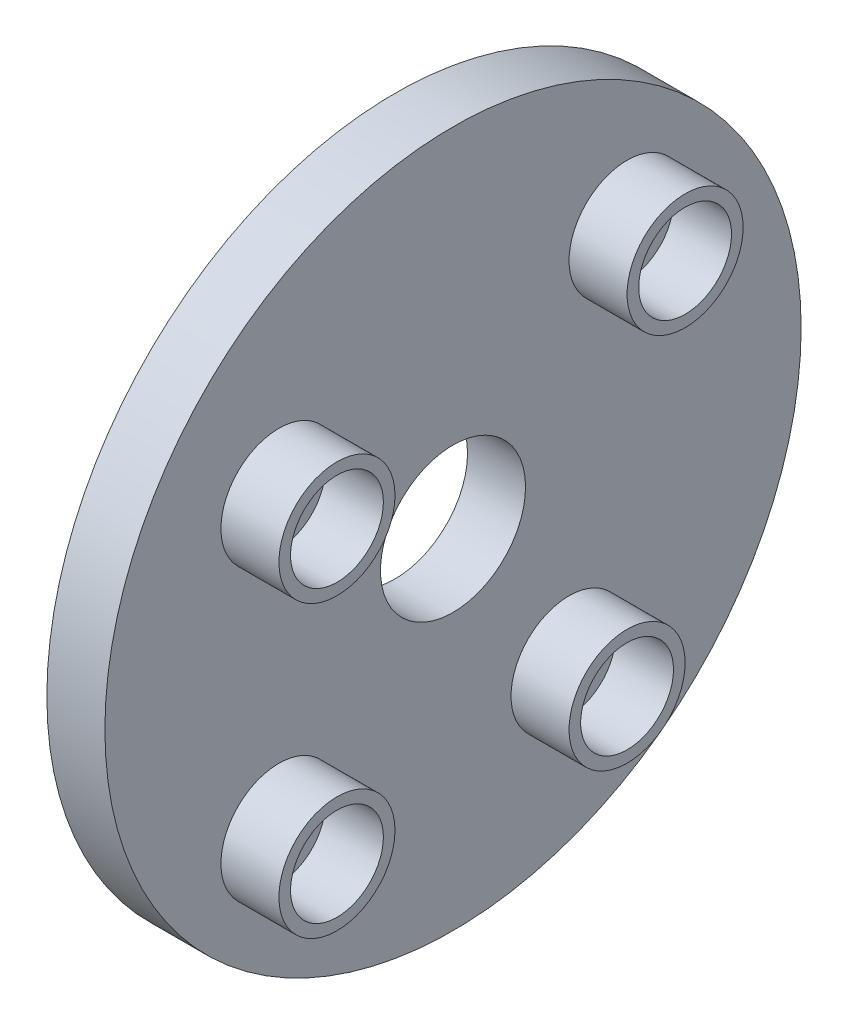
from build123d import *

# Parameters (mm, degrees)
SKETCH1_R        = 10
SKETCH1_R_2      = 8
EXTRUDE1_DEPTH   = 10
EXTRUDE1_2_DEPTH = 10
EXTRUDE1_3_DEPTH = 10
EXTRUDE1_4_DEPTH = 10
SKETCH3_R        = 60
SKETCH3_R_2      = 12.5
EXTRUDE2_DEPTH   = 10


with BuildPart() as part:
    # Sketch1 → Extrude1 (new body)
    with BuildSketch(Plane(origin=(0, 0, 0), x_dir=(0, 0, -1), z_dir=(1, 0, 0))):
        with Locations((-30, -30)):
            Circle(SKETCH1_R)
        with Locations((-30, -30)):
            Circle(SKETCH1_R_2, mode=Mode.SUBTRACT)
    extrude(amount=EXTRUDE1_DEPTH)



with BuildPart() as body_2:
    # Sketch1 → Extrude1 2 (new body)
    with BuildSketch(Plane(origin=(0, 0, 0), x_dir=(0, 0, -1), z_dir=(1, 0, 0))):
        with Locations((20, -30)):
            Circle(SKETCH1_R)
        with Locations((20, -30)):
            Circle(SKETCH1_R_2, mode=Mode.SUBTRACT)
    extrude(amount=EXTRUDE1_2_DEPTH)


with BuildPart() as body_3:
    # Sketch1 → Extrude1 3 (new body)
    with BuildSketch(Plane(origin=(0, 0, 0), x_dir=(0, 0, -1), z_dir=(1, 0, 0))):
        with Locations((30, 30)):
            Circle(SKETCH1_R)
        with Locations((30, 30)):
            Circle(SKETCH1_R_2, mode=Mode.SUBTRACT)
    extrude(amount=EXTRUDE1_3_DEPTH)


with BuildPart() as body_4:
    # Sketch1 → Extrude1 4 (new body)
    with BuildSketch(Plane(origin=(0, 0, 0), x_dir=(0, 0, -1), z_dir=(1, 0, 0))):
        with Locations((-30, 20)):
            Circle(SKETCH1_R)
        with Locations((-30, 20)):
            Circle(SKETCH1_R_2, mode=Mode.SUBTRACT)
    extrude(amount=EXTRUDE1_4_DEPTH)


with BuildPart() as part_1:
    add(part.part)

    add(body_2.part)  # Extrude2 merges body 2

    add(body_3.part)  # Extrude2 merges body 3

    add(body_4.part)  # Extrude2 merges body 4
    # Sketch3 → Extrude2 (add)
    with BuildSketch(Plane(origin=(0, 0, 0), x_dir=(0, 0, -1), z_dir=(1, 0, 0))):
        Circle(SKETCH3_R)
        Circle(SKETCH3_R_2, mode=Mode.SUBTRACT)
    extrude(amount=-EXTRUDE2_DEPTH)


solid = part_1.part
